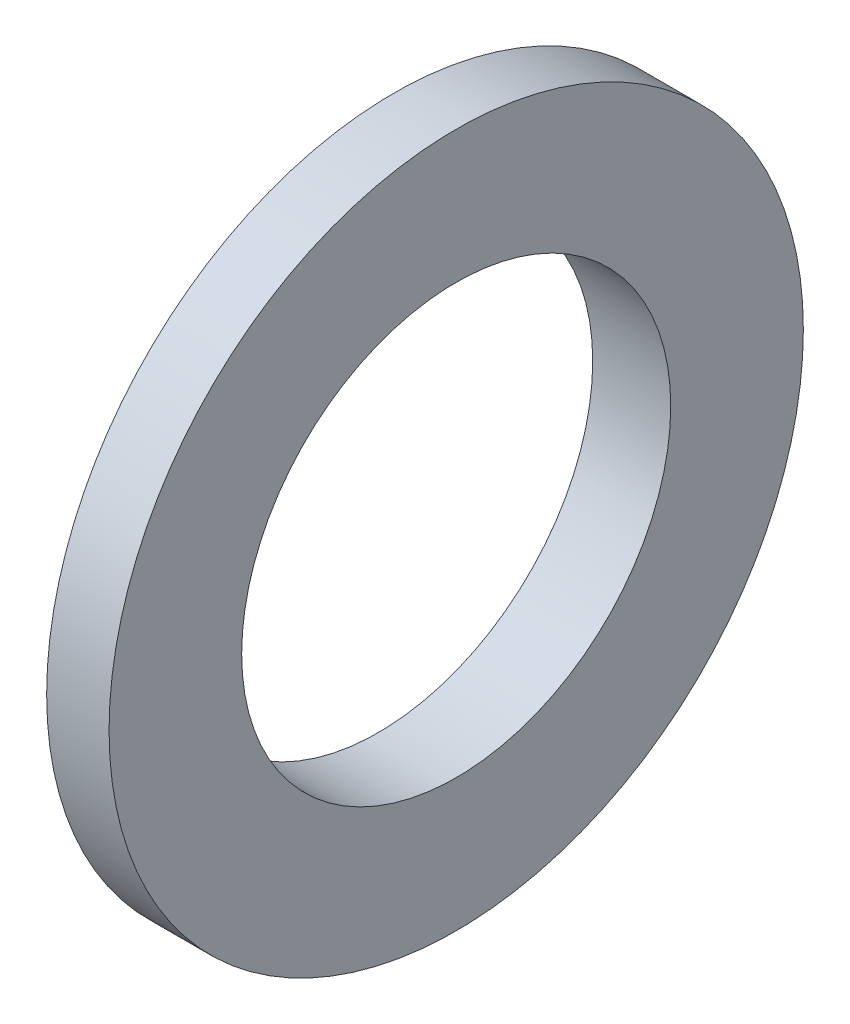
ISO-10303-21;
HEADER;
FILE_DESCRIPTION(('STEP AP214'),'2;1');
FILE_NAME('part.step','',(''),(''),'','','');
FILE_SCHEMA(('AUTOMOTIVE_DESIGN { 1 0 10303 214 1 1 1 1 }'));
ENDSEC;
DATA;
#1=APPLICATION_CONTEXT('core data for automotive mechanical design processes');
#2=APPLICATION_PROTOCOL_DEFINITION('international standard','automotive_design',2000,#1);
#3=PRODUCT_CONTEXT('',#1,'mechanical');
#4=PRODUCT('Part','Part','',(#3));
#5=PRODUCT_RELATED_PRODUCT_CATEGORY('part','',(#4));
#6=PRODUCT_DEFINITION_FORMATION('','',#4);
#7=PRODUCT_DEFINITION_CONTEXT('part definition',#1,'design');
#8=PRODUCT_DEFINITION('design','',#6,#7);
#9=PRODUCT_DEFINITION_SHAPE('','',#8);
#10=(LENGTH_UNIT() NAMED_UNIT(*) SI_UNIT(.MILLI.,.METRE.));
#11=(NAMED_UNIT(*) PLANE_ANGLE_UNIT() SI_UNIT($,.RADIAN.));
#12=(NAMED_UNIT(*) SI_UNIT($,.STERADIAN.) SOLID_ANGLE_UNIT());
#13=UNCERTAINTY_MEASURE_WITH_UNIT(LENGTH_MEASURE(1.E-05),#10,'distance_accuracy_value','');
#14=(GEOMETRIC_REPRESENTATION_CONTEXT(3) GLOBAL_UNCERTAINTY_ASSIGNED_CONTEXT((#13)) GLOBAL_UNIT_ASSIGNED_CONTEXT((#10,
#11,#12)) REPRESENTATION_CONTEXT('',''));
#15=CARTESIAN_POINT('',(0.,0.,0.));
#16=DIRECTION('',(0.,0.,1.));
#17=DIRECTION('',(1.,0.,0.));
#18=AXIS2_PLACEMENT_3D('',#15,#16,#17);
#19=CARTESIAN_POINT('',(-28.4122201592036,0.,0.));
#20=DIRECTION('',(-1.,0.,0.));
#21=DIRECTION('',(0.,0.,1.));
#22=AXIS2_PLACEMENT_3D('',#19,#20,#21);
#23=CYLINDRICAL_SURFACE('',#22,27.5);
#24=CARTESIAN_POINT('',(10.,0.,0.));
#25=DIRECTION('',(-1.,0.,0.));
#26=DIRECTION('',(0.,0.,1.));
#27=AXIS2_PLACEMENT_3D('',#24,#25,#26);
#28=CIRCLE('',#27,27.5);
#29=CARTESIAN_POINT('',(10.,0.,27.5));
#30=VERTEX_POINT('',#29);
#31=EDGE_CURVE('E10',#30,#30,#28,.T.);
#32=ORIENTED_EDGE('',*,*,#31,.F.);
#33=EDGE_LOOP('',(#32));
#34=FACE_BOUND('',#33,.T.);
#35=CARTESIAN_POINT('',(0.,0.,0.));
#36=DIRECTION('',(-1.,0.,0.));
#37=DIRECTION('',(0.,0.,1.));
#38=AXIS2_PLACEMENT_3D('',#35,#36,#37);
#39=CIRCLE('',#38,27.5);
#40=CARTESIAN_POINT('',(0.,0.,27.5));
#41=VERTEX_POINT('',#40);
#42=EDGE_CURVE('E470',#41,#41,#39,.T.);
#43=ORIENTED_EDGE('',*,*,#42,.T.);
#44=EDGE_LOOP('',(#43));
#45=FACE_BOUND('',#44,.T.);
#46=ADVANCED_FACE('F448',(#34,#45),#23,.F.);
#47=CARTESIAN_POINT('',(10.,44.5,0.));
#48=DIRECTION('',(-1.,0.,0.));
#49=DIRECTION('',(0.,0.,1.));
#50=AXIS2_PLACEMENT_3D('',#47,#48,#49);
#51=PLANE('',#50);
#52=CARTESIAN_POINT('',(10.,0.,0.));
#53=DIRECTION('',(-1.,0.,0.));
#54=DIRECTION('',(0.,0.,1.));
#55=AXIS2_PLACEMENT_3D('',#52,#53,#54);
#56=CIRCLE('',#55,44.5);
#57=CARTESIAN_POINT('',(10.,0.,44.5));
#58=VERTEX_POINT('',#57);
#59=EDGE_CURVE('E454',#58,#58,#56,.T.);
#60=ORIENTED_EDGE('',*,*,#59,.F.);
#61=EDGE_LOOP('',(#60));
#62=FACE_BOUND('',#61,.T.);
#63=ORIENTED_EDGE('',*,*,#31,.T.);
#64=EDGE_LOOP('',(#63));
#65=FACE_BOUND('',#64,.T.);
#66=ADVANCED_FACE('F495',(#62,#65),#51,.F.);
#67=CARTESIAN_POINT('',(-28.4122201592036,0.,0.));
#68=DIRECTION('',(-1.,0.,0.));
#69=DIRECTION('',(0.,0.,1.));
#70=AXIS2_PLACEMENT_3D('',#67,#68,#69);
#71=CYLINDRICAL_SURFACE('',#70,44.5);
#72=CARTESIAN_POINT('',(2.,0.,0.));
#73=DIRECTION('',(-1.,0.,0.));
#74=DIRECTION('',(0.,0.,1.));
#75=AXIS2_PLACEMENT_3D('',#72,#73,#74);
#76=CIRCLE('',#75,44.5);
#77=CARTESIAN_POINT('',(2.,0.,44.5));
#78=VERTEX_POINT('',#77);
#79=EDGE_CURVE('E458',#78,#78,#76,.T.);
#80=ORIENTED_EDGE('',*,*,#79,.F.);
#81=EDGE_LOOP('',(#80));
#82=FACE_BOUND('',#81,.T.);
#83=ORIENTED_EDGE('',*,*,#59,.T.);
#84=EDGE_LOOP('',(#83));
#85=FACE_BOUND('',#84,.T.);
#86=ADVANCED_FACE('F490',(#82,#85),#71,.T.);
#87=CARTESIAN_POINT('',(2.,44.5,0.));
#88=DIRECTION('',(1.,0.,0.));
#89=DIRECTION('',(0.,0.,-1.));
#90=AXIS2_PLACEMENT_3D('',#87,#88,#89);
#91=PLANE('',#90);
#92=CARTESIAN_POINT('',(2.,0.,0.));
#93=DIRECTION('',(-1.,0.,0.));
#94=DIRECTION('',(0.,0.,1.));
#95=AXIS2_PLACEMENT_3D('',#92,#93,#94);
#96=CIRCLE('',#95,32.5);
#97=CARTESIAN_POINT('',(2.,0.,32.5));
#98=VERTEX_POINT('',#97);
#99=EDGE_CURVE('E462',#98,#98,#96,.T.);
#100=ORIENTED_EDGE('',*,*,#99,.F.);
#101=EDGE_LOOP('',(#100));
#102=FACE_BOUND('',#101,.T.);
#103=ORIENTED_EDGE('',*,*,#79,.T.);
#104=EDGE_LOOP('',(#103));
#105=FACE_BOUND('',#104,.T.);
#106=ADVANCED_FACE('F484',(#102,#105),#91,.F.);
#107=CARTESIAN_POINT('',(-28.4122201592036,0.,0.));
#108=DIRECTION('',(-1.,0.,0.));
#109=DIRECTION('',(0.,0.,1.));
#110=AXIS2_PLACEMENT_3D('',#107,#108,#109);
#111=CYLINDRICAL_SURFACE('',#110,32.5);
#112=CARTESIAN_POINT('',(0.,0.,0.));
#113=DIRECTION('',(-1.,0.,0.));
#114=DIRECTION('',(0.,0.,1.));
#115=AXIS2_PLACEMENT_3D('',#112,#113,#114);
#116=CIRCLE('',#115,32.5);
#117=CARTESIAN_POINT('',(0.,0.,32.5));
#118=VERTEX_POINT('',#117);
#119=EDGE_CURVE('E467',#118,#118,#116,.T.);
#120=ORIENTED_EDGE('',*,*,#119,.F.);
#121=EDGE_LOOP('',(#120));
#122=FACE_BOUND('',#121,.T.);
#123=ORIENTED_EDGE('',*,*,#99,.T.);
#124=EDGE_LOOP('',(#123));
#125=FACE_BOUND('',#124,.T.);
#126=ADVANCED_FACE('F478',(#122,#125),#111,.T.);
#127=CARTESIAN_POINT('',(0.,27.5,0.));
#128=DIRECTION('',(1.,0.,0.));
#129=DIRECTION('',(0.,0.,-1.));
#130=AXIS2_PLACEMENT_3D('',#127,#128,#129);
#131=PLANE('',#130);
#132=ORIENTED_EDGE('',*,*,#42,.F.);
#133=EDGE_LOOP('',(#132));
#134=FACE_BOUND('',#133,.T.);
#135=ORIENTED_EDGE('',*,*,#119,.T.);
#136=EDGE_LOOP('',(#135));
#137=FACE_BOUND('',#136,.T.);
#138=ADVANCED_FACE('F475',(#134,#137),#131,.F.);
#139=CLOSED_SHELL('',(#46,#66,#86,#106,#126,#138));
#140=MANIFOLD_SOLID_BREP('B2',#139);
#141=ADVANCED_BREP_SHAPE_REPRESENTATION('',(#18,#140),#14);
#142=SHAPE_DEFINITION_REPRESENTATION(#9,#141);
ENDSEC;
END-ISO-10303-21;
